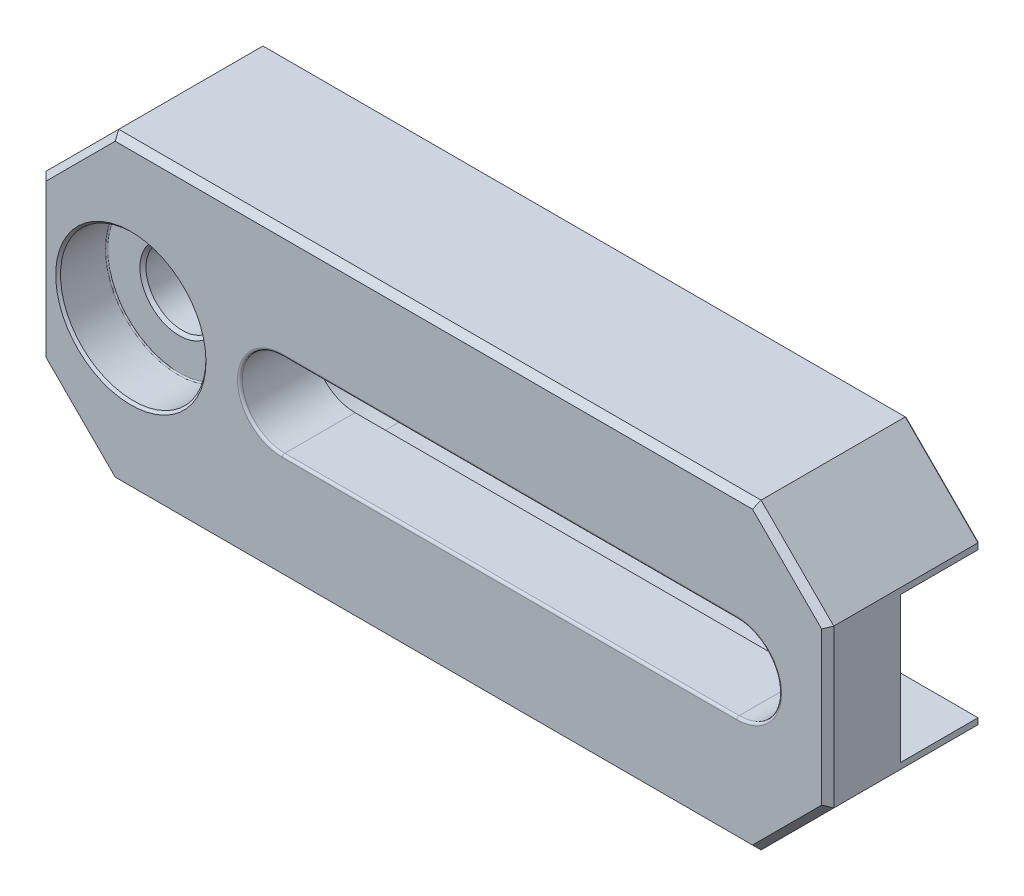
ISO-10303-21;
HEADER;
FILE_DESCRIPTION(('STEP AP214'),'2;1');
FILE_NAME('part.step','',(''),(''),'','','');
FILE_SCHEMA(('AUTOMOTIVE_DESIGN { 1 0 10303 214 1 1 1 1 }'));
ENDSEC;
DATA;
#1=APPLICATION_CONTEXT('core data for automotive mechanical design processes');
#2=APPLICATION_PROTOCOL_DEFINITION('international standard','automotive_design',2000,#1);
#3=PRODUCT_CONTEXT('',#1,'mechanical');
#4=PRODUCT('Part','Part','',(#3));
#5=PRODUCT_RELATED_PRODUCT_CATEGORY('part','',(#4));
#6=PRODUCT_DEFINITION_FORMATION('','',#4);
#7=PRODUCT_DEFINITION_CONTEXT('part definition',#1,'design');
#8=PRODUCT_DEFINITION('design','',#6,#7);
#9=PRODUCT_DEFINITION_SHAPE('','',#8);
#10=(LENGTH_UNIT() NAMED_UNIT(*) SI_UNIT(.MILLI.,.METRE.));
#11=(NAMED_UNIT(*) PLANE_ANGLE_UNIT() SI_UNIT($,.RADIAN.));
#12=(NAMED_UNIT(*) SI_UNIT($,.STERADIAN.) SOLID_ANGLE_UNIT());
#13=UNCERTAINTY_MEASURE_WITH_UNIT(LENGTH_MEASURE(1.E-05),#10,'distance_accuracy_value','');
#14=(GEOMETRIC_REPRESENTATION_CONTEXT(3) GLOBAL_UNCERTAINTY_ASSIGNED_CONTEXT((#13)) GLOBAL_UNIT_ASSIGNED_CONTEXT((#10,
#11,#12)) REPRESENTATION_CONTEXT('',''));
#15=CARTESIAN_POINT('',(0.,0.,0.));
#16=DIRECTION('',(0.,0.,1.));
#17=DIRECTION('',(1.,0.,0.));
#18=AXIS2_PLACEMENT_3D('',#15,#16,#17);
#19=CARTESIAN_POINT('',(0.,-12.5,12.5));
#20=DIRECTION('',(-1.,0.,0.));
#21=DIRECTION('',(0.,-1.,0.));
#22=AXIS2_PLACEMENT_3D('',#19,#20,#21);
#23=PLANE('',#22);
#24=DIRECTION('',(0.,0.,-1.));
#25=VECTOR('',#24,1.);
#26=CARTESIAN_POINT('',(0.,6.49999999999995,12.5));
#27=LINE('',#26,#25);
#28=CARTESIAN_POINT('',(0.,6.49999999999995,12.));
#29=VERTEX_POINT('',#28);
#30=CARTESIAN_POINT('',(0.,6.49999999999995,0.100000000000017));
#31=VERTEX_POINT('',#30);
#32=EDGE_CURVE('E283',#29,#31,#27,.T.);
#33=ORIENTED_EDGE('',*,*,#32,.T.);
#34=DIRECTION('',(0.,-1.,0.));
#35=VECTOR('',#34,1.);
#36=CARTESIAN_POINT('',(0.,-6.49999999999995,0.100000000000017));
#37=LINE('',#36,#35);
#38=CARTESIAN_POINT('',(0.,-6.49999999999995,0.100000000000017));
#39=VERTEX_POINT('',#38);
#40=EDGE_CURVE('E11',#31,#39,#37,.T.);
#41=ORIENTED_EDGE('',*,*,#40,.T.);
#42=DIRECTION('',(0.,0.,1.));
#43=VECTOR('',#42,1.);
#44=CARTESIAN_POINT('',(0.,-6.49999999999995,12.5));
#45=LINE('',#44,#43);
#46=CARTESIAN_POINT('',(0.,-6.49999999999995,12.));
#47=VERTEX_POINT('',#46);
#48=EDGE_CURVE('E281',#39,#47,#45,.T.);
#49=ORIENTED_EDGE('',*,*,#48,.T.);
#50=DIRECTION('',(0.,1.,0.));
#51=VECTOR('',#50,1.);
#52=CARTESIAN_POINT('',(0.,-12.5,12.));
#53=LINE('',#52,#51);
#54=EDGE_CURVE('E329',#47,#29,#53,.T.);
#55=ORIENTED_EDGE('',*,*,#54,.T.);
#56=EDGE_LOOP('',(#33,#41,#49,#55));
#57=FACE_BOUND('',#56,.T.);
#58=ADVANCED_FACE('F34',(#57),#23,.T.);
#59=CARTESIAN_POINT('',(65.,-12.5,12.5));
#60=DIRECTION('',(0.,-1.,0.));
#61=DIRECTION('',(1.,0.,0.));
#62=AXIS2_PLACEMENT_3D('',#59,#60,#61);
#63=PLANE('',#62);
#64=DIRECTION('',(0.,0.,-1.));
#65=VECTOR('',#64,1.);
#66=CARTESIAN_POINT('',(6.0000000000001,-12.5,12.5));
#67=LINE('',#66,#65);
#68=CARTESIAN_POINT('',(6.0000000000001,-12.5,12.));
#69=VERTEX_POINT('',#68);
#70=CARTESIAN_POINT('',(6.0000000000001,-12.5,0.100000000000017));
#71=VERTEX_POINT('',#70);
#72=EDGE_CURVE('E291',#69,#71,#67,.T.);
#73=ORIENTED_EDGE('',*,*,#72,.T.);
#74=DIRECTION('',(1.,0.,0.));
#75=VECTOR('',#74,1.);
#76=CARTESIAN_POINT('',(58.9999999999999,-12.5,0.100000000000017));
#77=LINE('',#76,#75);
#78=CARTESIAN_POINT('',(58.9999999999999,-12.5,0.100000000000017));
#79=VERTEX_POINT('',#78);
#80=EDGE_CURVE('E431',#71,#79,#77,.T.);
#81=ORIENTED_EDGE('',*,*,#80,.T.);
#82=DIRECTION('',(0.,0.,1.));
#83=VECTOR('',#82,1.);
#84=CARTESIAN_POINT('',(58.9999999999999,-12.5,12.5));
#85=LINE('',#84,#83);
#86=CARTESIAN_POINT('',(58.9999999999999,-12.5,12.));
#87=VERTEX_POINT('',#86);
#88=EDGE_CURVE('E289',#79,#87,#85,.T.);
#89=ORIENTED_EDGE('',*,*,#88,.T.);
#90=DIRECTION('',(-1.,0.,0.));
#91=VECTOR('',#90,1.);
#92=CARTESIAN_POINT('',(65.,-12.5,12.));
#93=LINE('',#92,#91);
#94=EDGE_CURVE('E324',#87,#69,#93,.T.);
#95=ORIENTED_EDGE('',*,*,#94,.T.);
#96=EDGE_LOOP('',(#73,#81,#89,#95));
#97=FACE_BOUND('',#96,.T.);
#98=ADVANCED_FACE('F518',(#97),#63,.T.);
#99=CARTESIAN_POINT('',(65.,12.5,12.5));
#100=DIRECTION('',(1.,0.,0.));
#101=DIRECTION('',(0.,0.,-1.));
#102=AXIS2_PLACEMENT_3D('',#99,#100,#101);
#103=PLANE('',#102);
#104=DIRECTION('',(0.,0.,-1.));
#105=VECTOR('',#104,1.);
#106=CARTESIAN_POINT('',(65.,-6.49999999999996,12.5));
#107=LINE('',#106,#105);
#108=CARTESIAN_POINT('',(65.,-6.49999999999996,12.));
#109=VERTEX_POINT('',#108);
#110=CARTESIAN_POINT('',(65.,-6.49999999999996,0.100000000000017));
#111=VERTEX_POINT('',#110);
#112=EDGE_CURVE('E296',#109,#111,#107,.T.);
#113=ORIENTED_EDGE('',*,*,#112,.T.);
#114=DIRECTION('',(0.,1.,0.));
#115=VECTOR('',#114,1.);
#116=CARTESIAN_POINT('',(65.,-6.,0.100000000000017));
#117=LINE('',#116,#115);
#118=CARTESIAN_POINT('',(65.,-6.,0.100000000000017));
#119=VERTEX_POINT('',#118);
#120=EDGE_CURVE('E437',#111,#119,#117,.T.);
#121=ORIENTED_EDGE('',*,*,#120,.T.);
#122=DIRECTION('',(0.,0.,-1.));
#123=VECTOR('',#122,1.);
#124=CARTESIAN_POINT('',(65.,-6.,12.5));
#125=LINE('',#124,#123);
#126=CARTESIAN_POINT('',(65.,-6.,6.5));
#127=VERTEX_POINT('',#126);
#128=EDGE_CURVE('E268',#127,#119,#125,.T.);
#129=ORIENTED_EDGE('',*,*,#128,.F.);
#130=DIRECTION('',(0.,1.,0.));
#131=VECTOR('',#130,1.);
#132=CARTESIAN_POINT('',(65.,12.5,6.5));
#133=LINE('',#132,#131);
#134=CARTESIAN_POINT('',(65.,5.99999999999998,6.5));
#135=VERTEX_POINT('',#134);
#136=EDGE_CURVE('E278',#127,#135,#133,.T.);
#137=ORIENTED_EDGE('',*,*,#136,.T.);
#138=DIRECTION('',(0.,0.,1.));
#139=VECTOR('',#138,1.);
#140=CARTESIAN_POINT('',(65.,5.99999999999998,12.5));
#141=LINE('',#140,#139);
#142=CARTESIAN_POINT('',(65.,5.99999999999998,0.100000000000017));
#143=VERTEX_POINT('',#142);
#144=EDGE_CURVE('E273',#143,#135,#141,.T.);
#145=ORIENTED_EDGE('',*,*,#144,.F.);
#146=DIRECTION('',(0.,1.,0.));
#147=VECTOR('',#146,1.);
#148=CARTESIAN_POINT('',(65.,6.49999999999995,0.100000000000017));
#149=LINE('',#148,#147);
#150=CARTESIAN_POINT('',(65.,6.49999999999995,0.100000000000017));
#151=VERTEX_POINT('',#150);
#152=EDGE_CURVE('E435',#143,#151,#149,.T.);
#153=ORIENTED_EDGE('',*,*,#152,.T.);
#154=DIRECTION('',(0.,0.,1.));
#155=VECTOR('',#154,1.);
#156=CARTESIAN_POINT('',(65.,6.49999999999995,12.5));
#157=LINE('',#156,#155);
#158=CARTESIAN_POINT('',(65.,6.49999999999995,12.));
#159=VERTEX_POINT('',#158);
#160=EDGE_CURVE('E294',#151,#159,#157,.T.);
#161=ORIENTED_EDGE('',*,*,#160,.T.);
#162=DIRECTION('',(0.,-1.,0.));
#163=VECTOR('',#162,1.);
#164=CARTESIAN_POINT('',(65.,12.5,12.));
#165=LINE('',#164,#163);
#166=EDGE_CURVE('E319',#159,#109,#165,.T.);
#167=ORIENTED_EDGE('',*,*,#166,.T.);
#168=EDGE_LOOP('',(#113,#121,#129,#137,#145,#153,#161,#167));
#169=FACE_BOUND('',#168,.T.);
#170=ADVANCED_FACE('F497',(#169),#103,.T.);
#171=CARTESIAN_POINT('',(0.,12.5,12.5));
#172=DIRECTION('',(0.,1.,0.));
#173=DIRECTION('',(-1.,0.,0.));
#174=AXIS2_PLACEMENT_3D('',#171,#172,#173);
#175=PLANE('',#174);
#176=DIRECTION('',(0.,0.,-1.));
#177=VECTOR('',#176,1.);
#178=CARTESIAN_POINT('',(58.9999999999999,12.5,12.5));
#179=LINE('',#178,#177);
#180=CARTESIAN_POINT('',(58.9999999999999,12.5,12.));
#181=VERTEX_POINT('',#180);
#182=CARTESIAN_POINT('',(58.9999999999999,12.5,0.100000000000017));
#183=VERTEX_POINT('',#182);
#184=EDGE_CURVE('E285',#181,#183,#179,.T.);
#185=ORIENTED_EDGE('',*,*,#184,.T.);
#186=DIRECTION('',(-1.,0.,0.));
#187=VECTOR('',#186,1.);
#188=CARTESIAN_POINT('',(6.0000000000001,12.5,0.100000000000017));
#189=LINE('',#188,#187);
#190=CARTESIAN_POINT('',(6.0000000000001,12.5,0.100000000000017));
#191=VERTEX_POINT('',#190);
#192=EDGE_CURVE('E58',#183,#191,#189,.T.);
#193=ORIENTED_EDGE('',*,*,#192,.T.);
#194=DIRECTION('',(0.,0.,1.));
#195=VECTOR('',#194,1.);
#196=CARTESIAN_POINT('',(6.0000000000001,12.5,12.5));
#197=LINE('',#196,#195);
#198=CARTESIAN_POINT('',(6.0000000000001,12.5,12.));
#199=VERTEX_POINT('',#198);
#200=EDGE_CURVE('E287',#191,#199,#197,.T.);
#201=ORIENTED_EDGE('',*,*,#200,.T.);
#202=DIRECTION('',(1.,0.,0.));
#203=VECTOR('',#202,1.);
#204=CARTESIAN_POINT('',(0.,12.5,12.));
#205=LINE('',#204,#203);
#206=EDGE_CURVE('E334',#199,#181,#205,.T.);
#207=ORIENTED_EDGE('',*,*,#206,.T.);
#208=EDGE_LOOP('',(#185,#193,#201,#207));
#209=FACE_BOUND('',#208,.T.);
#210=ADVANCED_FACE('F528',(#209),#175,.T.);
#211=CARTESIAN_POINT('',(0.,-12.5,12.5));
#212=DIRECTION('',(0.,0.,1.));
#213=DIRECTION('',(1.,0.,0.));
#214=AXIS2_PLACEMENT_3D('',#211,#212,#213);
#215=PLANE('',#214);
#216=CARTESIAN_POINT('',(7.5,0.,12.5));
#217=DIRECTION('',(0.,0.,1.));
#218=DIRECTION('',(1.,0.,0.));
#219=AXIS2_PLACEMENT_3D('',#216,#217,#218);
#220=CIRCLE('',#219,6.20000000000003);
#221=CARTESIAN_POINT('',(13.7,0.,12.5));
#222=VERTEX_POINT('',#221);
#223=EDGE_CURVE('E388',#222,#222,#220,.F.);
#224=ORIENTED_EDGE('',*,*,#223,.T.);
#225=EDGE_LOOP('',(#224));
#226=FACE_BOUND('',#225,.T.);
#227=DIRECTION('',(-1.,0.,0.));
#228=VECTOR('',#227,1.);
#229=CARTESIAN_POINT('',(57.5,3.7,12.5));
#230=LINE('',#229,#228);
#231=CARTESIAN_POINT('',(20.,3.7,12.5));
#232=VERTEX_POINT('',#231);
#233=CARTESIAN_POINT('',(57.5,3.7,12.5));
#234=VERTEX_POINT('',#233);
#235=EDGE_CURVE('E361',#232,#234,#230,.F.);
#236=ORIENTED_EDGE('',*,*,#235,.T.);
#237=CARTESIAN_POINT('',(57.5,0.,12.5));
#238=DIRECTION('',(0.,0.,1.));
#239=DIRECTION('',(1.,0.,0.));
#240=AXIS2_PLACEMENT_3D('',#237,#238,#239);
#241=CIRCLE('',#240,3.7);
#242=CARTESIAN_POINT('',(57.5,-3.7,12.5));
#243=VERTEX_POINT('',#242);
#244=EDGE_CURVE('E367',#234,#243,#241,.F.);
#245=ORIENTED_EDGE('',*,*,#244,.T.);
#246=DIRECTION('',(1.,0.,0.));
#247=VECTOR('',#246,1.);
#248=CARTESIAN_POINT('',(20.,-3.7,12.5));
#249=LINE('',#248,#247);
#250=CARTESIAN_POINT('',(20.,-3.7,12.5));
#251=VERTEX_POINT('',#250);
#252=EDGE_CURVE('E365',#243,#251,#249,.F.);
#253=ORIENTED_EDGE('',*,*,#252,.T.);
#254=CARTESIAN_POINT('',(20.,0.,12.5));
#255=DIRECTION('',(0.,0.,1.));
#256=DIRECTION('',(1.,0.,0.));
#257=AXIS2_PLACEMENT_3D('',#254,#255,#256);
#258=CIRCLE('',#257,3.7);
#259=EDGE_CURVE('E363',#251,#232,#258,.F.);
#260=ORIENTED_EDGE('',*,*,#259,.T.);
#261=EDGE_LOOP('',(#236,#245,#253,#260));
#262=FACE_BOUND('',#261,.T.);
#263=DIRECTION('',(0.,1.,0.));
#264=VECTOR('',#263,1.);
#265=CARTESIAN_POINT('',(64.5,-12.5,12.5));
#266=LINE('',#265,#264);
#267=CARTESIAN_POINT('',(64.5,-6.29289321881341,12.5));
#268=VERTEX_POINT('',#267);
#269=CARTESIAN_POINT('',(64.5,6.29289321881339,12.5));
#270=VERTEX_POINT('',#269);
#271=EDGE_CURVE('E311',#268,#270,#266,.T.);
#272=ORIENTED_EDGE('',*,*,#271,.T.);
#273=DIRECTION('',(-0.707106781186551,0.707106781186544,0.));
#274=VECTOR('',#273,1.);
#275=CARTESIAN_POINT('',(41.6464466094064,29.1464466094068,12.5));
#276=LINE('',#275,#274);
#277=CARTESIAN_POINT('',(58.7928932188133,12.,12.5));
#278=VERTEX_POINT('',#277);
#279=EDGE_CURVE('E313',#270,#278,#276,.T.);
#280=ORIENTED_EDGE('',*,*,#279,.T.);
#281=DIRECTION('',(-1.,0.,0.));
#282=VECTOR('',#281,1.);
#283=CARTESIAN_POINT('',(0.,12.,12.5));
#284=LINE('',#283,#282);
#285=CARTESIAN_POINT('',(6.20710678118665,12.,12.5));
#286=VERTEX_POINT('',#285);
#287=EDGE_CURVE('E299',#278,#286,#284,.T.);
#288=ORIENTED_EDGE('',*,*,#287,.T.);
#289=DIRECTION('',(-0.707106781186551,-0.707106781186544,0.));
#290=VECTOR('',#289,1.);
#291=CARTESIAN_POINT('',(-9.1464466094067,-3.3535533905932,12.5));
#292=LINE('',#291,#290);
#293=CARTESIAN_POINT('',(0.500000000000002,6.2928932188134,12.5));
#294=VERTEX_POINT('',#293);
#295=EDGE_CURVE('E301',#286,#294,#292,.T.);
#296=ORIENTED_EDGE('',*,*,#295,.T.);
#297=DIRECTION('',(0.,-1.,0.));
#298=VECTOR('',#297,1.);
#299=CARTESIAN_POINT('',(0.5,-12.5,12.5));
#300=LINE('',#299,#298);
#301=CARTESIAN_POINT('',(0.500000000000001,-6.29289321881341,12.5));
#302=VERTEX_POINT('',#301);
#303=EDGE_CURVE('E303',#294,#302,#300,.T.);
#304=ORIENTED_EDGE('',*,*,#303,.T.);
#305=DIRECTION('',(0.707106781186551,-0.707106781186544,0.));
#306=VECTOR('',#305,1.);
#307=CARTESIAN_POINT('',(3.35355339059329,-9.14644660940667,12.5));
#308=LINE('',#307,#306);
#309=CARTESIAN_POINT('',(6.20710678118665,-12.,12.5));
#310=VERTEX_POINT('',#309);
#311=EDGE_CURVE('E305',#302,#310,#308,.T.);
#312=ORIENTED_EDGE('',*,*,#311,.T.);
#313=DIRECTION('',(1.,0.,0.));
#314=VECTOR('',#313,1.);
#315=CARTESIAN_POINT('',(0.,-12.,12.5));
#316=LINE('',#315,#314);
#317=CARTESIAN_POINT('',(58.7928932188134,-12.,12.5));
#318=VERTEX_POINT('',#317);
#319=EDGE_CURVE('E307',#310,#318,#316,.T.);
#320=ORIENTED_EDGE('',*,*,#319,.T.);
#321=DIRECTION('',(0.707106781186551,0.707106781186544,0.));
#322=VECTOR('',#321,1.);
#323=CARTESIAN_POINT('',(29.1464466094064,-41.6464466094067,12.5));
#324=LINE('',#323,#322);
#325=EDGE_CURVE('E309',#318,#268,#324,.T.);
#326=ORIENTED_EDGE('',*,*,#325,.T.);
#327=EDGE_LOOP('',(#272,#280,#288,#296,#304,#312,#320,#326));
#328=FACE_BOUND('',#327,.T.);
#329=ADVANCED_FACE('F790',(#226,#262,#328),#215,.T.);
#330=CARTESIAN_POINT('',(0.,-12.5,0.));
#331=DIRECTION('',(0.,0.,1.));
#332=DIRECTION('',(1.,0.,0.));
#333=AXIS2_PLACEMENT_3D('',#330,#331,#332);
#334=PLANE('',#333);
#335=DIRECTION('',(-1.,0.,0.));
#336=VECTOR('',#335,1.);
#337=CARTESIAN_POINT('',(6.00000000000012,-12.4,0.));
#338=LINE('',#337,#336);
#339=CARTESIAN_POINT('',(58.9585786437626,-12.4,0.));
#340=VERTEX_POINT('',#339);
#341=CARTESIAN_POINT('',(6.04142135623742,-12.4,0.));
#342=VERTEX_POINT('',#341);
#343=EDGE_CURVE('E423',#340,#342,#338,.T.);
#344=ORIENTED_EDGE('',*,*,#343,.T.);
#345=DIRECTION('',(-0.707106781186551,0.707106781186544,0.));
#346=VECTOR('',#345,1.);
#347=CARTESIAN_POINT('',(0.0707106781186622,-6.42928932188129,0.));
#348=LINE('',#347,#346);
#349=CARTESIAN_POINT('',(0.100000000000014,-6.45857864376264,0.));
#350=VERTEX_POINT('',#349);
#351=EDGE_CURVE('E425',#342,#350,#348,.T.);
#352=ORIENTED_EDGE('',*,*,#351,.T.);
#353=DIRECTION('',(0.,1.,0.));
#354=VECTOR('',#353,1.);
#355=CARTESIAN_POINT('',(0.100000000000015,6.49999999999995,0.));
#356=LINE('',#355,#354);
#357=CARTESIAN_POINT('',(0.100000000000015,6.45857864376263,0.));
#358=VERTEX_POINT('',#357);
#359=EDGE_CURVE('E403',#350,#358,#356,.T.);
#360=ORIENTED_EDGE('',*,*,#359,.T.);
#361=DIRECTION('',(0.707106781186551,0.707106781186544,0.));
#362=VECTOR('',#361,1.);
#363=CARTESIAN_POINT('',(6.07071067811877,12.4292893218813,0.));
#364=LINE('',#363,#362);
#365=CARTESIAN_POINT('',(6.04142135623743,12.4,0.));
#366=VERTEX_POINT('',#365);
#367=EDGE_CURVE('E405',#358,#366,#364,.T.);
#368=ORIENTED_EDGE('',*,*,#367,.T.);
#369=DIRECTION('',(1.,0.,0.));
#370=VECTOR('',#369,1.);
#371=CARTESIAN_POINT('',(58.9999999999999,12.4,0.));
#372=LINE('',#371,#370);
#373=CARTESIAN_POINT('',(58.9585786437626,12.4,0.));
#374=VERTEX_POINT('',#373);
#375=EDGE_CURVE('E407',#366,#374,#372,.T.);
#376=ORIENTED_EDGE('',*,*,#375,.T.);
#377=DIRECTION('',(0.707106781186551,-0.707106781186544,0.));
#378=VECTOR('',#377,1.);
#379=CARTESIAN_POINT('',(64.9292893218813,6.42928932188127,0.));
#380=LINE('',#379,#378);
#381=CARTESIAN_POINT('',(64.9,6.45857864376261,0.));
#382=VERTEX_POINT('',#381);
#383=EDGE_CURVE('E409',#374,#382,#380,.T.);
#384=ORIENTED_EDGE('',*,*,#383,.T.);
#385=DIRECTION('',(0.,-1.,0.));
#386=VECTOR('',#385,1.);
#387=CARTESIAN_POINT('',(64.9,5.99999999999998,0.));
#388=LINE('',#387,#386);
#389=CARTESIAN_POINT('',(64.9,6.1,0.));
#390=VERTEX_POINT('',#389);
#391=EDGE_CURVE('E411',#382,#390,#388,.T.);
#392=ORIENTED_EDGE('',*,*,#391,.T.);
#393=DIRECTION('',(-1.,0.,0.));
#394=VECTOR('',#393,1.);
#395=CARTESIAN_POINT('',(0.,6.10000000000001,0.));
#396=LINE('',#395,#394);
#397=CARTESIAN_POINT('',(20.,6.10000000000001,0.));
#398=VERTEX_POINT('',#397);
#399=EDGE_CURVE('E413',#390,#398,#396,.T.);
#400=ORIENTED_EDGE('',*,*,#399,.T.);
#401=CARTESIAN_POINT('',(20.,0.,0.));
#402=DIRECTION('',(0.,0.,1.));
#403=DIRECTION('',(1.,0.,0.));
#404=AXIS2_PLACEMENT_3D('',#401,#402,#403);
#405=CIRCLE('',#404,6.10000000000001);
#406=CARTESIAN_POINT('',(20.,-6.10000000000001,0.));
#407=VERTEX_POINT('',#406);
#408=EDGE_CURVE('E415',#398,#407,#405,.T.);
#409=ORIENTED_EDGE('',*,*,#408,.T.);
#410=DIRECTION('',(1.,0.,0.));
#411=VECTOR('',#410,1.);
#412=CARTESIAN_POINT('',(0.,-6.10000000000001,0.));
#413=LINE('',#412,#411);
#414=CARTESIAN_POINT('',(64.9,-6.10000000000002,0.));
#415=VERTEX_POINT('',#414);
#416=EDGE_CURVE('E417',#407,#415,#413,.T.);
#417=ORIENTED_EDGE('',*,*,#416,.T.);
#418=DIRECTION('',(0.,-1.,0.));
#419=VECTOR('',#418,1.);
#420=CARTESIAN_POINT('',(64.9,-6.49999999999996,0.));
#421=LINE('',#420,#419);
#422=CARTESIAN_POINT('',(64.9,-6.45857864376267,0.));
#423=VERTEX_POINT('',#422);
#424=EDGE_CURVE('E419',#415,#423,#421,.T.);
#425=ORIENTED_EDGE('',*,*,#424,.T.);
#426=DIRECTION('',(-0.707106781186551,-0.707106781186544,0.));
#427=VECTOR('',#426,1.);
#428=CARTESIAN_POINT('',(58.9292893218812,-12.4292893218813,0.));
#429=LINE('',#428,#427);
#430=EDGE_CURVE('E421',#423,#340,#429,.T.);
#431=ORIENTED_EDGE('',*,*,#430,.T.);
#432=EDGE_LOOP('',(#344,#352,#360,#368,#376,#384,#392,#400,#409,#417,#425,#431));
#433=FACE_BOUND('',#432,.T.);
#434=CARTESIAN_POINT('',(7.5,0.,0.));
#435=DIRECTION('',(0.,0.,1.));
#436=DIRECTION('',(1.,0.,0.));
#437=AXIS2_PLACEMENT_3D('',#434,#435,#436);
#438=CIRCLE('',#437,3.00000000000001);
#439=CARTESIAN_POINT('',(10.5,0.,0.));
#440=VERTEX_POINT('',#439);
#441=EDGE_CURVE('E275',#440,#440,#438,.T.);
#442=ORIENTED_EDGE('',*,*,#441,.T.);
#443=EDGE_LOOP('',(#442));
#444=FACE_BOUND('',#443,.T.);
#445=ADVANCED_FACE('F784',(#433,#444),#334,.F.);
#446=CARTESIAN_POINT('',(7.5,0.,12.5));
#447=DIRECTION('',(0.,0.,1.));
#448=DIRECTION('',(1.,0.,0.));
#449=AXIS2_PLACEMENT_3D('',#446,#447,#448);
#450=CYLINDRICAL_SURFACE('',#449,6.00000000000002);
#451=CARTESIAN_POINT('',(7.5,0.,8.6));
#452=DIRECTION('',(0.,0.,-1.));
#453=DIRECTION('',(-1.,0.,0.));
#454=AXIS2_PLACEMENT_3D('',#451,#452,#453);
#455=CIRCLE('',#454,6.00000000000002);
#456=CARTESIAN_POINT('',(1.49999999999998,0.,8.6));
#457=VERTEX_POINT('',#456);
#458=EDGE_CURVE('E394',#457,#457,#455,.T.);
#459=ORIENTED_EDGE('',*,*,#458,.T.);
#460=EDGE_LOOP('',(#459));
#461=FACE_BOUND('',#460,.T.);
#462=CARTESIAN_POINT('',(7.5,0.,12.3));
#463=DIRECTION('',(0.,0.,1.));
#464=DIRECTION('',(1.,0.,0.));
#465=AXIS2_PLACEMENT_3D('',#462,#463,#464);
#466=CIRCLE('',#465,6.00000000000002);
#467=CARTESIAN_POINT('',(13.5,0.,12.3));
#468=VERTEX_POINT('',#467);
#469=EDGE_CURVE('E376',#468,#468,#466,.T.);
#470=ORIENTED_EDGE('',*,*,#469,.T.);
#471=EDGE_LOOP('',(#470));
#472=FACE_BOUND('',#471,.T.);
#473=ADVANCED_FACE('F789',(#461,#472),#450,.F.);
#474=CARTESIAN_POINT('',(10.5,0.,8.5));
#475=DIRECTION('',(0.,0.,-1.));
#476=DIRECTION('',(-1.,0.,0.));
#477=AXIS2_PLACEMENT_3D('',#474,#475,#476);
#478=PLANE('',#477);
#479=CARTESIAN_POINT('',(7.5,0.,8.5));
#480=DIRECTION('',(0.,0.,-1.));
#481=DIRECTION('',(-1.,0.,0.));
#482=AXIS2_PLACEMENT_3D('',#479,#480,#481);
#483=CIRCLE('',#482,3.25000000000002);
#484=CARTESIAN_POINT('',(4.24999999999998,0.,8.5));
#485=VERTEX_POINT('',#484);
#486=EDGE_CURVE('E400',#485,#485,#483,.T.);
#487=ORIENTED_EDGE('',*,*,#486,.T.);
#488=EDGE_LOOP('',(#487));
#489=FACE_BOUND('',#488,.T.);
#490=CARTESIAN_POINT('',(7.5,0.,8.5));
#491=DIRECTION('',(0.,0.,-1.));
#492=DIRECTION('',(-1.,0.,0.));
#493=AXIS2_PLACEMENT_3D('',#490,#491,#492);
#494=CIRCLE('',#493,5.90000000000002);
#495=CARTESIAN_POINT('',(1.59999999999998,0.,8.5));
#496=VERTEX_POINT('',#495);
#497=EDGE_CURVE('E391',#496,#496,#494,.F.);
#498=ORIENTED_EDGE('',*,*,#497,.T.);
#499=EDGE_LOOP('',(#498));
#500=FACE_BOUND('',#499,.T.);
#501=ADVANCED_FACE('F827',(#489,#500),#478,.F.);
#502=CARTESIAN_POINT('',(7.5,0.,12.5));
#503=DIRECTION('',(0.,0.,1.));
#504=DIRECTION('',(1.,0.,0.));
#505=AXIS2_PLACEMENT_3D('',#502,#503,#504);
#506=CYLINDRICAL_SURFACE('',#505,3.00000000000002);
#507=CARTESIAN_POINT('',(7.5,0.,8.25));
#508=DIRECTION('',(0.,0.,-1.));
#509=DIRECTION('',(-1.,0.,0.));
#510=AXIS2_PLACEMENT_3D('',#507,#508,#509);
#511=CIRCLE('',#510,3.00000000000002);
#512=CARTESIAN_POINT('',(4.49999999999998,0.,8.25));
#513=VERTEX_POINT('',#512);
#514=EDGE_CURVE('E397',#513,#513,#511,.F.);
#515=ORIENTED_EDGE('',*,*,#514,.T.);
#516=EDGE_LOOP('',(#515));
#517=FACE_BOUND('',#516,.T.);
#518=ORIENTED_EDGE('',*,*,#441,.F.);
#519=EDGE_LOOP('',(#518));
#520=FACE_BOUND('',#519,.T.);
#521=ADVANCED_FACE('F515',(#517,#520),#506,.F.);
#522=CARTESIAN_POINT('',(20.,5.99999999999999,6.5));
#523=DIRECTION('',(0.,1.,0.));
#524=DIRECTION('',(-1.,0.,0.));
#525=AXIS2_PLACEMENT_3D('',#522,#523,#524);
#526=PLANE('',#525);
#527=DIRECTION('',(0.,0.,-1.));
#528=VECTOR('',#527,1.);
#529=CARTESIAN_POINT('',(20.,5.99999999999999,6.5));
#530=LINE('',#529,#528);
#531=CARTESIAN_POINT('',(20.,5.99999999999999,6.5));
#532=VERTEX_POINT('',#531);
#533=CARTESIAN_POINT('',(20.,5.99999999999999,0.100000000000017));
#534=VERTEX_POINT('',#533);
#535=EDGE_CURVE('E265',#532,#534,#530,.T.);
#536=ORIENTED_EDGE('',*,*,#535,.T.);
#537=DIRECTION('',(1.,0.,0.));
#538=VECTOR('',#537,1.);
#539=CARTESIAN_POINT('',(20.,5.99999999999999,0.100000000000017));
#540=LINE('',#539,#538);
#541=EDGE_CURVE('E443',#534,#143,#540,.T.);
#542=ORIENTED_EDGE('',*,*,#541,.T.);
#543=ORIENTED_EDGE('',*,*,#144,.T.);
#544=DIRECTION('',(1.,0.,0.));
#545=VECTOR('',#544,1.);
#546=CARTESIAN_POINT('',(20.,5.99999999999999,6.5));
#547=LINE('',#546,#545);
#548=EDGE_CURVE('E261',#532,#135,#547,.T.);
#549=ORIENTED_EDGE('',*,*,#548,.F.);
#550=EDGE_LOOP('',(#536,#542,#543,#549));
#551=FACE_BOUND('',#550,.T.);
#552=ADVANCED_FACE('F494',(#551),#526,.F.);
#553=CARTESIAN_POINT('',(20.,0.,6.5));
#554=DIRECTION('',(0.,0.,-1.));
#555=DIRECTION('',(-1.,0.,0.));
#556=AXIS2_PLACEMENT_3D('',#553,#554,#555);
#557=CYLINDRICAL_SURFACE('',#556,5.99999999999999);
#558=DIRECTION('',(0.,0.,-1.));
#559=VECTOR('',#558,1.);
#560=CARTESIAN_POINT('',(20.,-6.,6.5));
#561=LINE('',#560,#559);
#562=CARTESIAN_POINT('',(20.,-6.,6.5));
#563=VERTEX_POINT('',#562);
#564=CARTESIAN_POINT('',(20.,-6.,0.100000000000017));
#565=VERTEX_POINT('',#564);
#566=EDGE_CURVE('E264',#563,#565,#561,.T.);
#567=ORIENTED_EDGE('',*,*,#566,.T.);
#568=CARTESIAN_POINT('',(20.,0.,0.100000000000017));
#569=DIRECTION('',(0.,0.,1.));
#570=DIRECTION('',(1.,0.,0.));
#571=AXIS2_PLACEMENT_3D('',#568,#569,#570);
#572=CIRCLE('',#571,5.99999999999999);
#573=EDGE_CURVE('E441',#565,#534,#572,.F.);
#574=ORIENTED_EDGE('',*,*,#573,.T.);
#575=ORIENTED_EDGE('',*,*,#535,.F.);
#576=CARTESIAN_POINT('',(20.,0.,6.5));
#577=DIRECTION('',(0.,0.,-1.));
#578=DIRECTION('',(-1.,0.,0.));
#579=AXIS2_PLACEMENT_3D('',#576,#577,#578);
#580=CIRCLE('',#579,5.99999999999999);
#581=EDGE_CURVE('E258',#563,#532,#580,.T.);
#582=ORIENTED_EDGE('',*,*,#581,.F.);
#583=EDGE_LOOP('',(#567,#574,#575,#582));
#584=FACE_BOUND('',#583,.T.);
#585=ADVANCED_FACE('F507',(#584),#557,.F.);
#586=CARTESIAN_POINT('',(70.,-6.,6.5));
#587=DIRECTION('',(0.,-1.,0.));
#588=DIRECTION('',(1.,0.,0.));
#589=AXIS2_PLACEMENT_3D('',#586,#587,#588);
#590=PLANE('',#589);
#591=ORIENTED_EDGE('',*,*,#128,.T.);
#592=DIRECTION('',(-1.,0.,0.));
#593=VECTOR('',#592,1.);
#594=CARTESIAN_POINT('',(70.,-6.,0.100000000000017));
#595=LINE('',#594,#593);
#596=EDGE_CURVE('E439',#119,#565,#595,.T.);
#597=ORIENTED_EDGE('',*,*,#596,.T.);
#598=ORIENTED_EDGE('',*,*,#566,.F.);
#599=DIRECTION('',(-1.,0.,0.));
#600=VECTOR('',#599,1.);
#601=CARTESIAN_POINT('',(70.,-6.,6.5));
#602=LINE('',#601,#600);
#603=EDGE_CURVE('E231',#127,#563,#602,.T.);
#604=ORIENTED_EDGE('',*,*,#603,.F.);
#605=EDGE_LOOP('',(#591,#597,#598,#604));
#606=FACE_BOUND('',#605,.T.);
#607=ADVANCED_FACE('F503',(#606),#590,.F.);
#608=CARTESIAN_POINT('',(20.,0.,6.5));
#609=DIRECTION('',(0.,0.,-1.));
#610=DIRECTION('',(-1.,0.,0.));
#611=AXIS2_PLACEMENT_3D('',#608,#609,#610);
#612=PLANE('',#611);
#613=CARTESIAN_POINT('',(57.5,0.,6.5));
#614=DIRECTION('',(0.,0.,-1.));
#615=DIRECTION('',(-1.,0.,0.));
#616=AXIS2_PLACEMENT_3D('',#613,#614,#615);
#617=CIRCLE('',#616,3.5);
#618=CARTESIAN_POINT('',(57.5,-3.5,6.5));
#619=VERTEX_POINT('',#618);
#620=CARTESIAN_POINT('',(57.5,3.5,6.5));
#621=VERTEX_POINT('',#620);
#622=EDGE_CURVE('E238',#619,#621,#617,.F.);
#623=ORIENTED_EDGE('',*,*,#622,.T.);
#624=DIRECTION('',(-1.,0.,0.));
#625=VECTOR('',#624,1.);
#626=CARTESIAN_POINT('',(57.5,3.5,6.5));
#627=LINE('',#626,#625);
#628=CARTESIAN_POINT('',(20.,3.5,6.5));
#629=VERTEX_POINT('',#628);
#630=EDGE_CURVE('E221',#621,#629,#627,.T.);
#631=ORIENTED_EDGE('',*,*,#630,.T.);
#632=CARTESIAN_POINT('',(20.,0.,6.5));
#633=DIRECTION('',(0.,0.,-1.));
#634=DIRECTION('',(-1.,0.,0.));
#635=AXIS2_PLACEMENT_3D('',#632,#633,#634);
#636=CIRCLE('',#635,3.5);
#637=CARTESIAN_POINT('',(20.,-3.5,6.5));
#638=VERTEX_POINT('',#637);
#639=EDGE_CURVE('E248',#629,#638,#636,.F.);
#640=ORIENTED_EDGE('',*,*,#639,.T.);
#641=DIRECTION('',(1.,0.,0.));
#642=VECTOR('',#641,1.);
#643=CARTESIAN_POINT('',(20.,-3.5,6.5));
#644=LINE('',#643,#642);
#645=EDGE_CURVE('E246',#638,#619,#644,.T.);
#646=ORIENTED_EDGE('',*,*,#645,.T.);
#647=EDGE_LOOP('',(#623,#631,#640,#646));
#648=FACE_BOUND('',#647,.T.);
#649=ORIENTED_EDGE('',*,*,#603,.T.);
#650=ORIENTED_EDGE('',*,*,#581,.T.);
#651=ORIENTED_EDGE('',*,*,#548,.T.);
#652=ORIENTED_EDGE('',*,*,#136,.F.);
#653=EDGE_LOOP('',(#649,#650,#651,#652));
#654=FACE_BOUND('',#653,.T.);
#655=ADVANCED_FACE('F244',(#648,#654),#612,.T.);
#656=CARTESIAN_POINT('',(57.5,0.,-0.000999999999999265));
#657=DIRECTION('',(0.,0.,1.));
#658=DIRECTION('',(1.,0.,0.));
#659=AXIS2_PLACEMENT_3D('',#656,#657,#658);
#660=CYLINDRICAL_SURFACE('',#659,3.5);
#661=DIRECTION('',(0.,0.,1.));
#662=VECTOR('',#661,1.);
#663=CARTESIAN_POINT('',(57.5,-3.5,-0.000999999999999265));
#664=LINE('',#663,#662);
#665=CARTESIAN_POINT('',(57.5,-3.5,12.3));
#666=VERTEX_POINT('',#665);
#667=EDGE_CURVE('E232',#619,#666,#664,.T.);
#668=ORIENTED_EDGE('',*,*,#667,.T.);
#669=CARTESIAN_POINT('',(57.5,0.,12.3));
#670=DIRECTION('',(0.,0.,1.));
#671=DIRECTION('',(1.,0.,0.));
#672=AXIS2_PLACEMENT_3D('',#669,#670,#671);
#673=CIRCLE('',#672,3.5);
#674=CARTESIAN_POINT('',(57.5,3.5,12.3));
#675=VERTEX_POINT('',#674);
#676=EDGE_CURVE('E241',#666,#675,#673,.T.);
#677=ORIENTED_EDGE('',*,*,#676,.T.);
#678=DIRECTION('',(0.,0.,1.));
#679=VECTOR('',#678,1.);
#680=CARTESIAN_POINT('',(57.5,3.5,-0.000999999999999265));
#681=LINE('',#680,#679);
#682=EDGE_CURVE('E224',#621,#675,#681,.T.);
#683=ORIENTED_EDGE('',*,*,#682,.F.);
#684=ORIENTED_EDGE('',*,*,#622,.F.);
#685=EDGE_LOOP('',(#668,#677,#683,#684));
#686=FACE_BOUND('',#685,.T.);
#687=ADVANCED_FACE('F237',(#686),#660,.F.);
#688=CARTESIAN_POINT('',(20.,-3.5,-0.000999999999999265));
#689=DIRECTION('',(0.,-1.,0.));
#690=DIRECTION('',(1.,0.,0.));
#691=AXIS2_PLACEMENT_3D('',#688,#689,#690);
#692=PLANE('',#691);
#693=DIRECTION('',(0.,0.,1.));
#694=VECTOR('',#693,1.);
#695=CARTESIAN_POINT('',(20.,-3.5,-0.000999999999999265));
#696=LINE('',#695,#694);
#697=CARTESIAN_POINT('',(20.,-3.5,12.3));
#698=VERTEX_POINT('',#697);
#699=EDGE_CURVE('E253',#638,#698,#696,.T.);
#700=ORIENTED_EDGE('',*,*,#699,.T.);
#701=DIRECTION('',(1.,0.,0.));
#702=VECTOR('',#701,1.);
#703=CARTESIAN_POINT('',(57.5,-3.5,12.3));
#704=LINE('',#703,#702);
#705=EDGE_CURVE('E370',#698,#666,#704,.T.);
#706=ORIENTED_EDGE('',*,*,#705,.T.);
#707=ORIENTED_EDGE('',*,*,#667,.F.);
#708=ORIENTED_EDGE('',*,*,#645,.F.);
#709=EDGE_LOOP('',(#700,#706,#707,#708));
#710=FACE_BOUND('',#709,.T.);
#711=ADVANCED_FACE('F745',(#710),#692,.F.);
#712=CARTESIAN_POINT('',(20.,0.,-0.000999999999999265));
#713=DIRECTION('',(0.,0.,1.));
#714=DIRECTION('',(1.,0.,0.));
#715=AXIS2_PLACEMENT_3D('',#712,#713,#714);
#716=CYLINDRICAL_SURFACE('',#715,3.5);
#717=DIRECTION('',(0.,0.,1.));
#718=VECTOR('',#717,1.);
#719=CARTESIAN_POINT('',(20.,3.5,-0.000999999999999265));
#720=LINE('',#719,#718);
#721=CARTESIAN_POINT('',(20.,3.5,12.3));
#722=VERTEX_POINT('',#721);
#723=EDGE_CURVE('E226',#629,#722,#720,.T.);
#724=ORIENTED_EDGE('',*,*,#723,.T.);
#725=CARTESIAN_POINT('',(20.,0.,12.3));
#726=DIRECTION('',(0.,0.,1.));
#727=DIRECTION('',(1.,0.,0.));
#728=AXIS2_PLACEMENT_3D('',#725,#726,#727);
#729=CIRCLE('',#728,3.5);
#730=EDGE_CURVE('E372',#722,#698,#729,.T.);
#731=ORIENTED_EDGE('',*,*,#730,.T.);
#732=ORIENTED_EDGE('',*,*,#699,.F.);
#733=ORIENTED_EDGE('',*,*,#639,.F.);
#734=EDGE_LOOP('',(#724,#731,#732,#733));
#735=FACE_BOUND('',#734,.T.);
#736=ADVANCED_FACE('F738',(#735),#716,.F.);
#737=CARTESIAN_POINT('',(57.5,3.5,-0.000999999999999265));
#738=DIRECTION('',(0.,1.,0.));
#739=DIRECTION('',(-1.,0.,0.));
#740=AXIS2_PLACEMENT_3D('',#737,#738,#739);
#741=PLANE('',#740);
#742=ORIENTED_EDGE('',*,*,#682,.T.);
#743=DIRECTION('',(-1.,0.,0.));
#744=VECTOR('',#743,1.);
#745=CARTESIAN_POINT('',(20.,3.5,12.3));
#746=LINE('',#745,#744);
#747=EDGE_CURVE('E374',#675,#722,#746,.T.);
#748=ORIENTED_EDGE('',*,*,#747,.T.);
#749=ORIENTED_EDGE('',*,*,#723,.F.);
#750=ORIENTED_EDGE('',*,*,#630,.F.);
#751=EDGE_LOOP('',(#742,#748,#749,#750));
#752=FACE_BOUND('',#751,.T.);
#753=ADVANCED_FACE('F223',(#752),#741,.F.);
#754=CARTESIAN_POINT('',(0.,6.49999999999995,12.5));
#755=DIRECTION('',(0.707106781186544,-0.707106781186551,0.));
#756=DIRECTION('',(0.707106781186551,0.707106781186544,0.));
#757=AXIS2_PLACEMENT_3D('',#754,#755,#756);
#758=PLANE('',#757);
#759=ORIENTED_EDGE('',*,*,#200,.F.);
#760=DIRECTION('',(0.707106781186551,0.707106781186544,0.));
#761=VECTOR('',#760,1.);
#762=CARTESIAN_POINT('',(0.,6.49999999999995,0.100000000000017));
#763=LINE('',#762,#761);
#764=EDGE_CURVE('E43',#191,#31,#763,.F.);
#765=ORIENTED_EDGE('',*,*,#764,.T.);
#766=ORIENTED_EDGE('',*,*,#32,.F.);
#767=DIRECTION('',(-0.707106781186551,-0.707106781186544,0.));
#768=VECTOR('',#767,1.);
#769=CARTESIAN_POINT('',(0.,6.49999999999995,12.));
#770=LINE('',#769,#768);
#771=EDGE_CURVE('E331',#29,#199,#770,.F.);
#772=ORIENTED_EDGE('',*,*,#771,.T.);
#773=EDGE_LOOP('',(#759,#765,#766,#772));
#774=FACE_BOUND('',#773,.T.);
#775=ADVANCED_FACE('F530',(#774),#758,.F.);
#776=CARTESIAN_POINT('',(6.0000000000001,-12.5,12.5));
#777=DIRECTION('',(0.707106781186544,0.707106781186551,0.));
#778=DIRECTION('',(-0.707106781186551,0.707106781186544,0.));
#779=AXIS2_PLACEMENT_3D('',#776,#777,#778);
#780=PLANE('',#779);
#781=ORIENTED_EDGE('',*,*,#48,.F.);
#782=DIRECTION('',(-0.707106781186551,0.707106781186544,0.));
#783=VECTOR('',#782,1.);
#784=CARTESIAN_POINT('',(6.00000000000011,-12.5,0.100000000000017));
#785=LINE('',#784,#783);
#786=EDGE_CURVE('E428',#39,#71,#785,.F.);
#787=ORIENTED_EDGE('',*,*,#786,.T.);
#788=ORIENTED_EDGE('',*,*,#72,.F.);
#789=DIRECTION('',(0.707106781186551,-0.707106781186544,0.));
#790=VECTOR('',#789,1.);
#791=CARTESIAN_POINT('',(6.0000000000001,-12.5,12.));
#792=LINE('',#791,#790);
#793=EDGE_CURVE('E326',#69,#47,#792,.F.);
#794=ORIENTED_EDGE('',*,*,#793,.T.);
#795=EDGE_LOOP('',(#781,#787,#788,#794));
#796=FACE_BOUND('',#795,.T.);
#797=ADVANCED_FACE('F533',(#796),#780,.F.);
#798=CARTESIAN_POINT('',(65.,-6.49999999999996,12.5));
#799=DIRECTION('',(-0.707106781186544,0.707106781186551,0.));
#800=DIRECTION('',(-0.707106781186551,-0.707106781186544,0.));
#801=AXIS2_PLACEMENT_3D('',#798,#799,#800);
#802=PLANE('',#801);
#803=ORIENTED_EDGE('',*,*,#88,.F.);
#804=DIRECTION('',(-0.707106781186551,-0.707106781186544,0.));
#805=VECTOR('',#804,1.);
#806=CARTESIAN_POINT('',(65.,-6.49999999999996,0.100000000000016));
#807=LINE('',#806,#805);
#808=EDGE_CURVE('E433',#79,#111,#807,.F.);
#809=ORIENTED_EDGE('',*,*,#808,.T.);
#810=ORIENTED_EDGE('',*,*,#112,.F.);
#811=DIRECTION('',(0.707106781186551,0.707106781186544,0.));
#812=VECTOR('',#811,1.);
#813=CARTESIAN_POINT('',(65.,-6.49999999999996,12.));
#814=LINE('',#813,#812);
#815=EDGE_CURVE('E321',#109,#87,#814,.F.);
#816=ORIENTED_EDGE('',*,*,#815,.T.);
#817=EDGE_LOOP('',(#803,#809,#810,#816));
#818=FACE_BOUND('',#817,.T.);
#819=ADVANCED_FACE('F536',(#818),#802,.F.);
#820=CARTESIAN_POINT('',(58.9999999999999,12.5,12.5));
#821=DIRECTION('',(-0.707106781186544,-0.707106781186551,0.));
#822=DIRECTION('',(0.707106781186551,-0.707106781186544,0.));
#823=AXIS2_PLACEMENT_3D('',#820,#821,#822);
#824=PLANE('',#823);
#825=ORIENTED_EDGE('',*,*,#160,.F.);
#826=DIRECTION('',(0.707106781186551,-0.707106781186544,0.));
#827=VECTOR('',#826,1.);
#828=CARTESIAN_POINT('',(58.9999999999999,12.5,0.100000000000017));
#829=LINE('',#828,#827);
#830=EDGE_CURVE('E445',#151,#183,#829,.F.);
#831=ORIENTED_EDGE('',*,*,#830,.T.);
#832=ORIENTED_EDGE('',*,*,#184,.F.);
#833=DIRECTION('',(-0.707106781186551,0.707106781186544,0.));
#834=VECTOR('',#833,1.);
#835=CARTESIAN_POINT('',(58.9999999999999,12.5,12.));
#836=LINE('',#835,#834);
#837=EDGE_CURVE('E316',#181,#159,#836,.F.);
#838=ORIENTED_EDGE('',*,*,#837,.T.);
#839=EDGE_LOOP('',(#825,#831,#832,#838));
#840=FACE_BOUND('',#839,.T.);
#841=ADVANCED_FACE('F540',(#840),#824,.F.);
#842=CARTESIAN_POINT('',(3.35355339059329,-9.14644660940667,12.5));
#843=DIRECTION('',(-0.5,-0.500000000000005,0.707106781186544));
#844=DIRECTION('',(0.,-0.816496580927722,-0.577350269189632));
#845=AXIS2_PLACEMENT_3D('',#842,#843,#844);
#846=PLANE('',#845);
#847=DIRECTION('',(-0.678598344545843,-0.28108463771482,-0.678598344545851));
#848=VECTOR('',#847,1.);
#849=CARTESIAN_POINT('',(-1.14446141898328,-6.97405144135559,10.8555385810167));
#850=LINE('',#849,#848);
#851=EDGE_CURVE('E354',#47,#302,#850,.F.);
#852=ORIENTED_EDGE('',*,*,#851,.F.);
#853=ORIENTED_EDGE('',*,*,#793,.F.);
#854=DIRECTION('',(-0.281084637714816,-0.678598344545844,-0.678598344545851));
#855=VECTOR('',#854,1.);
#856=CARTESIAN_POINT('',(6.52594855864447,-11.2302478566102,13.2697521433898));
#857=LINE('',#856,#855);
#858=EDGE_CURVE('E357',#310,#69,#857,.T.);
#859=ORIENTED_EDGE('',*,*,#858,.F.);
#860=ORIENTED_EDGE('',*,*,#311,.F.);
#861=EDGE_LOOP('',(#852,#853,#859,#860));
#862=FACE_BOUND('',#861,.T.);
#863=ADVANCED_FACE('F544',(#862),#846,.T.);
#864=CARTESIAN_POINT('',(65.,-12.5,12.));
#865=DIRECTION('',(0.,0.707106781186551,-0.707106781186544));
#866=DIRECTION('',(0.,0.707106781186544,0.707106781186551));
#867=AXIS2_PLACEMENT_3D('',#864,#865,#866);
#868=PLANE('',#867);
#869=ORIENTED_EDGE('',*,*,#858,.T.);
#870=ORIENTED_EDGE('',*,*,#94,.F.);
#871=DIRECTION('',(0.281084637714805,-0.678598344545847,-0.678598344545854));
#872=VECTOR('',#871,1.);
#873=CARTESIAN_POINT('',(59.4740514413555,-13.6444614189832,10.8555385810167));
#874=LINE('',#873,#872);
#875=EDGE_CURVE('E351',#318,#87,#874,.T.);
#876=ORIENTED_EDGE('',*,*,#875,.F.);
#877=ORIENTED_EDGE('',*,*,#319,.F.);
#878=EDGE_LOOP('',(#869,#870,#876,#877));
#879=FACE_BOUND('',#878,.T.);
#880=ADVANCED_FACE('F570',(#879),#868,.F.);
#881=CARTESIAN_POINT('',(0.,-12.5,12.));
#882=DIRECTION('',(0.707106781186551,0.,-0.707106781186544));
#883=DIRECTION('',(-0.707106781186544,0.,-0.707106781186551));
#884=AXIS2_PLACEMENT_3D('',#881,#882,#883);
#885=PLANE('',#884);
#886=ORIENTED_EDGE('',*,*,#851,.T.);
#887=ORIENTED_EDGE('',*,*,#303,.F.);
#888=DIRECTION('',(-0.678598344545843,0.281084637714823,-0.67859834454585));
#889=VECTOR('',#888,1.);
#890=CARTESIAN_POINT('',(-2.10214964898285,7.37073889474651,9.89785035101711));
#891=LINE('',#890,#889);
#892=EDGE_CURVE('E348',#29,#294,#891,.F.);
#893=ORIENTED_EDGE('',*,*,#892,.F.);
#894=ORIENTED_EDGE('',*,*,#54,.F.);
#895=EDGE_LOOP('',(#886,#887,#893,#894));
#896=FACE_BOUND('',#895,.T.);
#897=ADVANCED_FACE('F566',(#896),#885,.F.);
#898=CARTESIAN_POINT('',(29.1464466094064,-41.6464466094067,12.5));
#899=DIRECTION('',(0.500000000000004,-0.500000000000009,0.707106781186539));
#900=DIRECTION('',(0.,-0.816496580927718,-0.577350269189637));
#901=AXIS2_PLACEMENT_3D('',#898,#899,#900);
#902=PLANE('',#901);
#903=ORIENTED_EDGE('',*,*,#875,.T.);
#904=ORIENTED_EDGE('',*,*,#815,.F.);
#905=DIRECTION('',(0.678598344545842,-0.281084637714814,-0.678598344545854));
#906=VECTOR('',#905,1.);
#907=CARTESIAN_POINT('',(54.963303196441,-2.34266406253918,22.0366968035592));
#908=LINE('',#907,#906);
#909=EDGE_CURVE('E345',#268,#109,#908,.T.);
#910=ORIENTED_EDGE('',*,*,#909,.F.);
#911=ORIENTED_EDGE('',*,*,#325,.F.);
#912=EDGE_LOOP('',(#903,#904,#910,#911));
#913=FACE_BOUND('',#912,.T.);
#914=ADVANCED_FACE('F562',(#913),#902,.T.);
#915=CARTESIAN_POINT('',(-9.1464466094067,-3.3535533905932,12.5));
#916=DIRECTION('',(-0.5,0.500000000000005,0.707106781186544));
#917=DIRECTION('',(0.,-0.816496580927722,0.577350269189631));
#918=AXIS2_PLACEMENT_3D('',#915,#916,#917);
#919=PLANE('',#918);
#920=ORIENTED_EDGE('',*,*,#892,.T.);
#921=ORIENTED_EDGE('',*,*,#295,.F.);
#922=DIRECTION('',(-0.281084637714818,0.678598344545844,-0.678598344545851));
#923=VECTOR('',#922,1.);
#924=CARTESIAN_POINT('',(5.52594855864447,13.6444614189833,10.8555385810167));
#925=LINE('',#924,#923);
#926=EDGE_CURVE('E342',#199,#286,#925,.F.);
#927=ORIENTED_EDGE('',*,*,#926,.F.);
#928=ORIENTED_EDGE('',*,*,#771,.F.);
#929=EDGE_LOOP('',(#920,#921,#927,#928));
#930=FACE_BOUND('',#929,.T.);
#931=ADVANCED_FACE('F558',(#930),#919,.T.);
#932=CARTESIAN_POINT('',(65.,12.5,12.));
#933=DIRECTION('',(-0.707106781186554,0.,-0.707106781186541));
#934=DIRECTION('',(-0.707106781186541,0.,0.707106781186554));
#935=AXIS2_PLACEMENT_3D('',#932,#933,#934);
#936=PLANE('',#935);
#937=ORIENTED_EDGE('',*,*,#909,.T.);
#938=ORIENTED_EDGE('',*,*,#166,.F.);
#939=DIRECTION('',(0.67859834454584,0.281084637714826,-0.678598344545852));
#940=VECTOR('',#939,1.);
#941=CARTESIAN_POINT('',(66.1444614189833,6.9740514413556,10.8555385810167));
#942=LINE('',#941,#940);
#943=EDGE_CURVE('E338',#270,#159,#942,.T.);
#944=ORIENTED_EDGE('',*,*,#943,.F.);
#945=ORIENTED_EDGE('',*,*,#271,.F.);
#946=EDGE_LOOP('',(#937,#938,#944,#945));
#947=FACE_BOUND('',#946,.T.);
#948=ADVANCED_FACE('F554',(#947),#936,.F.);
#949=CARTESIAN_POINT('',(0.,12.5,12.));
#950=DIRECTION('',(0.,-0.707106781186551,-0.707106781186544));
#951=DIRECTION('',(0.,0.707106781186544,-0.707106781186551));
#952=AXIS2_PLACEMENT_3D('',#949,#950,#951);
#953=PLANE('',#952);
#954=ORIENTED_EDGE('',*,*,#926,.T.);
#955=ORIENTED_EDGE('',*,*,#287,.F.);
#956=DIRECTION('',(-0.281084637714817,-0.678598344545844,0.678598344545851));
#957=VECTOR('',#956,1.);
#958=CARTESIAN_POINT('',(54.338494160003,1.24612937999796,23.2538706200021));
#959=LINE('',#958,#957);
#960=EDGE_CURVE('E336',#181,#278,#959,.T.);
#961=ORIENTED_EDGE('',*,*,#960,.F.);
#962=ORIENTED_EDGE('',*,*,#206,.F.);
#963=EDGE_LOOP('',(#954,#955,#961,#962));
#964=FACE_BOUND('',#963,.T.);
#965=ADVANCED_FACE('F550',(#964),#953,.F.);
#966=CARTESIAN_POINT('',(41.6464466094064,29.1464466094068,12.5));
#967=DIRECTION('',(0.5,0.500000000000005,0.707106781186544));
#968=DIRECTION('',(0.,-0.816496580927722,0.577350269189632));
#969=AXIS2_PLACEMENT_3D('',#966,#967,#968);
#970=PLANE('',#969);
#971=ORIENTED_EDGE('',*,*,#943,.T.);
#972=ORIENTED_EDGE('',*,*,#837,.F.);
#973=ORIENTED_EDGE('',*,*,#960,.T.);
#974=ORIENTED_EDGE('',*,*,#279,.F.);
#975=EDGE_LOOP('',(#971,#972,#973,#974));
#976=FACE_BOUND('',#975,.T.);
#977=ADVANCED_FACE('F546',(#976),#970,.T.);
#978=CARTESIAN_POINT('',(20.,0.,12.3));
#979=DIRECTION('',(0.,0.,1.));
#980=DIRECTION('',(1.,0.,0.));
#981=AXIS2_PLACEMENT_3D('',#978,#979,#980);
#982=TOROIDAL_SURFACE('',#981,3.7,0.2);
#983=CARTESIAN_POINT('',(20.,3.70000000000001,12.3));
#984=DIRECTION('',(1.,0.,0.));
#985=DIRECTION('',(0.,0.,-1.));
#986=AXIS2_PLACEMENT_3D('',#983,#984,#985);
#987=CIRCLE('',#986,0.2);
#988=EDGE_CURVE('E381',#232,#722,#987,.T.);
#989=ORIENTED_EDGE('',*,*,#988,.F.);
#990=ORIENTED_EDGE('',*,*,#259,.F.);
#991=CARTESIAN_POINT('',(20.,-3.7,12.3));
#992=DIRECTION('',(1.,0.,0.));
#993=DIRECTION('',(0.,0.,-1.));
#994=AXIS2_PLACEMENT_3D('',#991,#992,#993);
#995=CIRCLE('',#994,0.2);
#996=EDGE_CURVE('E339',#698,#251,#995,.T.);
#997=ORIENTED_EDGE('',*,*,#996,.F.);
#998=ORIENTED_EDGE('',*,*,#730,.F.);
#999=EDGE_LOOP('',(#989,#990,#997,#998));
#1000=FACE_BOUND('',#999,.T.);
#1001=ADVANCED_FACE('F549',(#1000),#982,.T.);
#1002=CARTESIAN_POINT('',(20.,-3.7,12.3));
#1003=DIRECTION('',(-1.,0.,0.));
#1004=DIRECTION('',(0.,-1.,0.));
#1005=AXIS2_PLACEMENT_3D('',#1002,#1003,#1004);
#1006=CYLINDRICAL_SURFACE('',#1005,0.2);
#1007=ORIENTED_EDGE('',*,*,#996,.T.);
#1008=ORIENTED_EDGE('',*,*,#252,.F.);
#1009=CARTESIAN_POINT('',(57.5,-3.7,12.3));
#1010=DIRECTION('',(1.,0.,0.));
#1011=DIRECTION('',(0.,0.,-1.));
#1012=AXIS2_PLACEMENT_3D('',#1009,#1010,#1011);
#1013=CIRCLE('',#1012,0.2);
#1014=EDGE_CURVE('E379',#666,#243,#1013,.T.);
#1015=ORIENTED_EDGE('',*,*,#1014,.F.);
#1016=ORIENTED_EDGE('',*,*,#705,.F.);
#1017=EDGE_LOOP('',(#1007,#1008,#1015,#1016));
#1018=FACE_BOUND('',#1017,.T.);
#1019=ADVANCED_FACE('F586',(#1018),#1006,.T.);
#1020=CARTESIAN_POINT('',(57.5,3.7,12.3));
#1021=DIRECTION('',(1.,0.,0.));
#1022=DIRECTION('',(0.,1.,0.));
#1023=AXIS2_PLACEMENT_3D('',#1020,#1021,#1022);
#1024=CYLINDRICAL_SURFACE('',#1023,0.2);
#1025=ORIENTED_EDGE('',*,*,#988,.T.);
#1026=ORIENTED_EDGE('',*,*,#747,.F.);
#1027=CARTESIAN_POINT('',(57.5,3.7,12.3));
#1028=DIRECTION('',(1.,0.,0.));
#1029=DIRECTION('',(0.,0.,-1.));
#1030=AXIS2_PLACEMENT_3D('',#1027,#1028,#1029);
#1031=CIRCLE('',#1030,0.2);
#1032=EDGE_CURVE('E377',#234,#675,#1031,.T.);
#1033=ORIENTED_EDGE('',*,*,#1032,.F.);
#1034=ORIENTED_EDGE('',*,*,#235,.F.);
#1035=EDGE_LOOP('',(#1025,#1026,#1033,#1034));
#1036=FACE_BOUND('',#1035,.T.);
#1037=ADVANCED_FACE('F582',(#1036),#1024,.T.);
#1038=CARTESIAN_POINT('',(57.5,0.,12.3));
#1039=DIRECTION('',(0.,0.,1.));
#1040=DIRECTION('',(1.,0.,0.));
#1041=AXIS2_PLACEMENT_3D('',#1038,#1039,#1040);
#1042=TOROIDAL_SURFACE('',#1041,3.7,0.2);
#1043=ORIENTED_EDGE('',*,*,#1014,.T.);
#1044=ORIENTED_EDGE('',*,*,#244,.F.);
#1045=ORIENTED_EDGE('',*,*,#1032,.T.);
#1046=ORIENTED_EDGE('',*,*,#676,.F.);
#1047=EDGE_LOOP('',(#1043,#1044,#1045,#1046));
#1048=FACE_BOUND('',#1047,.T.);
#1049=ADVANCED_FACE('F578',(#1048),#1042,.T.);
#1050=CARTESIAN_POINT('',(7.5,0.,12.3));
#1051=DIRECTION('',(0.,0.,1.));
#1052=DIRECTION('',(1.,0.,0.));
#1053=AXIS2_PLACEMENT_3D('',#1050,#1051,#1052);
#1054=CONICAL_SURFACE('',#1053,6.00000000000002,0.785398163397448);
#1055=CARTESIAN_POINT('',(13.7,0.,12.5));
#1056=CARTESIAN_POINT('',(13.6979166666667,0.,12.4979166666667));
#1057=CARTESIAN_POINT('',(13.6958333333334,0.,12.4958333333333));
#1058=CARTESIAN_POINT('',(13.6916666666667,0.,12.4916666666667));
#1059=CARTESIAN_POINT('',(13.6895833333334,0.,12.4895833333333));
#1060=CARTESIAN_POINT('',(13.6854166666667,0.,12.4854166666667));
#1061=CARTESIAN_POINT('',(13.6833333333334,0.,12.4833333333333));
#1062=CARTESIAN_POINT('',(13.6791666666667,0.,12.4791666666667));
#1063=CARTESIAN_POINT('',(13.6770833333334,0.,12.4770833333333));
#1064=CARTESIAN_POINT('',(13.6729166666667,0.,12.4729166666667));
#1065=CARTESIAN_POINT('',(13.6708333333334,0.,12.4708333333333));
#1066=CARTESIAN_POINT('',(13.6666666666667,0.,12.4666666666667));
#1067=CARTESIAN_POINT('',(13.6645833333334,0.,12.4645833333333));
#1068=CARTESIAN_POINT('',(13.6604166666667,0.,12.4604166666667));
#1069=CARTESIAN_POINT('',(13.6583333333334,0.,12.4583333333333));
#1070=CARTESIAN_POINT('',(13.6541666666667,0.,12.4541666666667));
#1071=CARTESIAN_POINT('',(13.6520833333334,0.,12.4520833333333));
#1072=CARTESIAN_POINT('',(13.6479166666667,0.,12.4479166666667));
#1073=CARTESIAN_POINT('',(13.6458333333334,0.,12.4458333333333));
#1074=CARTESIAN_POINT('',(13.6416666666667,0.,12.4416666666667));
#1075=CARTESIAN_POINT('',(13.6395833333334,0.,12.4395833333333));
#1076=CARTESIAN_POINT('',(13.6354166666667,0.,12.4354166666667));
#1077=CARTESIAN_POINT('',(13.6333333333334,0.,12.4333333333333));
#1078=CARTESIAN_POINT('',(13.6291666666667,0.,12.4291666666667));
#1079=CARTESIAN_POINT('',(13.6270833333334,0.,12.4270833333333));
#1080=CARTESIAN_POINT('',(13.6229166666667,0.,12.4229166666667));
#1081=CARTESIAN_POINT('',(13.6208333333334,0.,12.4208333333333));
#1082=CARTESIAN_POINT('',(13.6166666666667,0.,12.4166666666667));
#1083=CARTESIAN_POINT('',(13.6145833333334,0.,12.4145833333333));
#1084=CARTESIAN_POINT('',(13.6104166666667,0.,12.4104166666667));
#1085=CARTESIAN_POINT('',(13.6083333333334,0.,12.4083333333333));
#1086=CARTESIAN_POINT('',(13.6041666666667,0.,12.4041666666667));
#1087=CARTESIAN_POINT('',(13.6020833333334,0.,12.4020833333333));
#1088=CARTESIAN_POINT('',(13.5979166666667,0.,12.3979166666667));
#1089=CARTESIAN_POINT('',(13.5958333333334,0.,12.3958333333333));
#1090=CARTESIAN_POINT('',(13.5916666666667,0.,12.3916666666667));
#1091=CARTESIAN_POINT('',(13.5895833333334,0.,12.3895833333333));
#1092=CARTESIAN_POINT('',(13.5854166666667,0.,12.3854166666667));
#1093=CARTESIAN_POINT('',(13.5833333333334,0.,12.3833333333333));
#1094=CARTESIAN_POINT('',(13.5791666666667,0.,12.3791666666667));
#1095=CARTESIAN_POINT('',(13.5770833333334,0.,12.3770833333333));
#1096=CARTESIAN_POINT('',(13.5729166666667,0.,12.3729166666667));
#1097=CARTESIAN_POINT('',(13.5708333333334,0.,12.3708333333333));
#1098=CARTESIAN_POINT('',(13.5666666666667,0.,12.3666666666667));
#1099=CARTESIAN_POINT('',(13.5645833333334,0.,12.3645833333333));
#1100=CARTESIAN_POINT('',(13.5604166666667,0.,12.3604166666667));
#1101=CARTESIAN_POINT('',(13.5583333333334,0.,12.3583333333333));
#1102=CARTESIAN_POINT('',(13.5541666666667,0.,12.3541666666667));
#1103=CARTESIAN_POINT('',(13.5520833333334,0.,12.3520833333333));
#1104=CARTESIAN_POINT('',(13.5479166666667,0.,12.3479166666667));
#1105=CARTESIAN_POINT('',(13.5458333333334,0.,12.3458333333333));
#1106=CARTESIAN_POINT('',(13.5416666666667,0.,12.3416666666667));
#1107=CARTESIAN_POINT('',(13.5395833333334,0.,12.3395833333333));
#1108=CARTESIAN_POINT('',(13.5354166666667,0.,12.3354166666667));
#1109=CARTESIAN_POINT('',(13.5333333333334,0.,12.3333333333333));
#1110=CARTESIAN_POINT('',(13.5291666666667,0.,12.3291666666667));
#1111=CARTESIAN_POINT('',(13.5270833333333,0.,12.3270833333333));
#1112=CARTESIAN_POINT('',(13.5229166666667,0.,12.3229166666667));
#1113=CARTESIAN_POINT('',(13.5208333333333,0.,12.3208333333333));
#1114=CARTESIAN_POINT('',(13.5166666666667,0.,12.3166666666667));
#1115=CARTESIAN_POINT('',(13.5145833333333,0.,12.3145833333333));
#1116=CARTESIAN_POINT('',(13.5104166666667,0.,12.3104166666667));
#1117=CARTESIAN_POINT('',(13.5083333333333,0.,12.3083333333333));
#1118=CARTESIAN_POINT('',(13.5041666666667,0.,12.3041666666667));
#1119=CARTESIAN_POINT('',(13.5020833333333,0.,12.3020833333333));
#1120=CARTESIAN_POINT('',(13.5,0.,12.3));
#1121=B_SPLINE_CURVE_WITH_KNOTS('',3,(#1055,#1056,#1057,#1058,#1059,#1060,#1061,#1062,#1063,
#1064,#1065,#1066,#1067,#1068,#1069,#1070,#1071,#1072,#1073,#1074,#1075,#1076,#1077,#1078,#1079,
#1080,#1081,#1082,#1083,#1084,#1085,#1086,#1087,#1088,#1089,#1090,#1091,#1092,#1093,#1094,#1095,
#1096,#1097,#1098,#1099,#1100,#1101,#1102,#1103,#1104,#1105,#1106,#1107,#1108,#1109,#1110,#1111,
#1112,#1113,#1114,#1115,#1116,#1117,#1118,#1119,#1120),.UNSPECIFIED.,.F.,.F.,(4,2,2,2,2,2,2,2,2,
2,2,2,2,2,2,2,2,2,2,2,2,2,2,2,2,2,2,2,2,2,2,2,4),(0.,0.0088388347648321,0.0176776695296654,
0.0265165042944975,0.0353553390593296,0.0441941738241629,0.053033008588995,0.0618718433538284,
0.0707106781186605,0.0795495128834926,0.0883883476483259,0.097227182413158,0.106066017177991,
0.114904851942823,0.123743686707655,0.132582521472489,0.141421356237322,0.150260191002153,
0.159099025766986,0.16793786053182,0.176776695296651,0.185615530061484,0.194454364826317,
0.203293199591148,0.212132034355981,0.220970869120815,0.229809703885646,0.238648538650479,
0.247487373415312,0.256326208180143,0.265165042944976,0.27400387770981,0.282842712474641),.UNSPECIFIED.);
#1122=EDGE_CURVE('BSEAM581',#222,#468,#1121,.T.);
#1123=ORIENTED_EDGE('',*,*,#223,.F.);
#1124=ORIENTED_EDGE('',*,*,#469,.F.);
#1125=ORIENTED_EDGE('',*,*,#1122,.T.);
#1126=ORIENTED_EDGE('',*,*,#1122,.F.);
#1127=EDGE_LOOP('',(#1123,#1125,#1124,#1126));
#1128=FACE_BOUND('',#1127,.T.);
#1129=ADVANCED_FACE('F581',(#1128),#1054,.F.);
#1130=CARTESIAN_POINT('',(7.5,0.,8.6));
#1131=DIRECTION('',(0.,0.,-1.));
#1132=DIRECTION('',(-1.,0.,0.));
#1133=AXIS2_PLACEMENT_3D('',#1130,#1131,#1132);
#1134=TOROIDAL_SURFACE('',#1133,5.90000000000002,0.1);
#1135=ORIENTED_EDGE('',*,*,#458,.F.);
#1136=EDGE_LOOP('',(#1135));
#1137=FACE_BOUND('',#1136,.T.);
#1138=ORIENTED_EDGE('',*,*,#497,.F.);
#1139=EDGE_LOOP('',(#1138));
#1140=FACE_BOUND('',#1139,.T.);
#1141=ADVANCED_FACE('F596',(#1137,#1140),#1134,.F.);
#1142=CARTESIAN_POINT('',(7.5,0.,8.25));
#1143=DIRECTION('',(0.,0.,1.));
#1144=DIRECTION('',(1.,0.,0.));
#1145=AXIS2_PLACEMENT_3D('',#1142,#1143,#1144);
#1146=CONICAL_SURFACE('',#1145,3.00000000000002,0.785398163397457);
#1147=ORIENTED_EDGE('',*,*,#486,.F.);
#1148=EDGE_LOOP('',(#1147));
#1149=FACE_BOUND('',#1148,.T.);
#1150=ORIENTED_EDGE('',*,*,#514,.F.);
#1151=EDGE_LOOP('',(#1150));
#1152=FACE_BOUND('',#1151,.T.);
#1153=ADVANCED_FACE('F600',(#1149,#1152),#1146,.F.);
#1154=CARTESIAN_POINT('',(20.,5.99999999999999,0.100000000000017));
#1155=DIRECTION('',(0.,0.70710678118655,0.707106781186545));
#1156=DIRECTION('',(0.,-0.707106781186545,0.70710678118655));
#1157=AXIS2_PLACEMENT_3D('',#1154,#1155,#1156);
#1158=PLANE('',#1157);
#1159=DIRECTION('',(0.577350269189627,-0.577350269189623,0.577350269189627));
#1160=VECTOR('',#1159,1.);
#1161=CARTESIAN_POINT('',(71.1,-0.0999999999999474,6.19999999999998));
#1162=LINE('',#1161,#1160);
#1163=EDGE_CURVE('E476',#143,#390,#1162,.F.);
#1164=ORIENTED_EDGE('',*,*,#1163,.F.);
#1165=ORIENTED_EDGE('',*,*,#541,.F.);
#1166=DIRECTION('',(0.,-0.707106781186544,0.707106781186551));
#1167=VECTOR('',#1166,1.);
#1168=CARTESIAN_POINT('',(20.,6.10000000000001,0.));
#1169=LINE('',#1168,#1167);
#1170=EDGE_CURVE('E38',#398,#534,#1169,.T.);
#1171=ORIENTED_EDGE('',*,*,#1170,.F.);
#1172=ORIENTED_EDGE('',*,*,#399,.F.);
#1173=EDGE_LOOP('',(#1164,#1165,#1171,#1172));
#1174=FACE_BOUND('',#1173,.T.);
#1175=ADVANCED_FACE('F36',(#1174),#1158,.F.);
#1176=CARTESIAN_POINT('',(20.,0.,0.100000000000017));
#1177=DIRECTION('',(0.,0.,-1.));
#1178=DIRECTION('',(-1.,0.,0.));
#1179=AXIS2_PLACEMENT_3D('',#1176,#1177,#1178);
#1180=CONICAL_SURFACE('',#1179,5.99999999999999,0.785398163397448);
#1181=ORIENTED_EDGE('',*,*,#1170,.T.);
#1182=ORIENTED_EDGE('',*,*,#573,.F.);
#1183=DIRECTION('',(0.,0.707106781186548,0.707106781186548));
#1184=VECTOR('',#1183,1.);
#1185=CARTESIAN_POINT('',(20.,-6.10000000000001,0.));
#1186=LINE('',#1185,#1184);
#1187=EDGE_CURVE('E474',#407,#565,#1186,.T.);
#1188=ORIENTED_EDGE('',*,*,#1187,.F.);
#1189=ORIENTED_EDGE('',*,*,#408,.F.);
#1190=EDGE_LOOP('',(#1181,#1182,#1188,#1189));
#1191=FACE_BOUND('',#1190,.T.);
#1192=ADVANCED_FACE('F487',(#1191),#1180,.F.);
#1193=CARTESIAN_POINT('',(64.9,-12.5,0.));
#1194=DIRECTION('',(0.707106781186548,0.,-0.707106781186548));
#1195=DIRECTION('',(-0.707106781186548,0.,-0.707106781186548));
#1196=AXIS2_PLACEMENT_3D('',#1193,#1194,#1195);
#1197=PLANE('',#1196);
#1198=ORIENTED_EDGE('',*,*,#1163,.T.);
#1199=ORIENTED_EDGE('',*,*,#391,.F.);
#1200=DIRECTION('',(0.678598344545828,0.281084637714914,0.678598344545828));
#1201=VECTOR('',#1200,1.);
#1202=CARTESIAN_POINT('',(58.7036015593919,3.89194637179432,-6.19639844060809));
#1203=LINE('',#1202,#1201);
#1204=EDGE_CURVE('E471',#151,#382,#1203,.F.);
#1205=ORIENTED_EDGE('',*,*,#1204,.F.);
#1206=ORIENTED_EDGE('',*,*,#152,.F.);
#1207=EDGE_LOOP('',(#1198,#1199,#1205,#1206));
#1208=FACE_BOUND('',#1207,.T.);
#1209=ADVANCED_FACE('F640',(#1208),#1197,.T.);
#1210=CARTESIAN_POINT('',(0.,-6.10000000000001,0.));
#1211=DIRECTION('',(0.,-0.707106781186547,0.707106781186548));
#1212=DIRECTION('',(0.,-0.707106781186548,-0.707106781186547));
#1213=AXIS2_PLACEMENT_3D('',#1210,#1211,#1212);
#1214=PLANE('',#1213);
#1215=ORIENTED_EDGE('',*,*,#1187,.T.);
#1216=ORIENTED_EDGE('',*,*,#596,.F.);
#1217=DIRECTION('',(0.577350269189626,0.577350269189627,0.577350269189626));
#1218=VECTOR('',#1217,1.);
#1219=CARTESIAN_POINT('',(43.2666666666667,-27.7333333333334,-21.6333333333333));
#1220=LINE('',#1219,#1218);
#1221=EDGE_CURVE('E468',#415,#119,#1220,.T.);
#1222=ORIENTED_EDGE('',*,*,#1221,.F.);
#1223=ORIENTED_EDGE('',*,*,#416,.F.);
#1224=EDGE_LOOP('',(#1215,#1216,#1222,#1223));
#1225=FACE_BOUND('',#1224,.T.);
#1226=ADVANCED_FACE('F636',(#1225),#1214,.F.);
#1227=CARTESIAN_POINT('',(41.929289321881,29.4292893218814,0.));
#1228=DIRECTION('',(-0.499999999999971,-0.499999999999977,0.707106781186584));
#1229=DIRECTION('',(0.,-0.816496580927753,-0.577350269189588));
#1230=AXIS2_PLACEMENT_3D('',#1227,#1228,#1229);
#1231=PLANE('',#1230);
#1232=ORIENTED_EDGE('',*,*,#1204,.T.);
#1233=ORIENTED_EDGE('',*,*,#383,.F.);
#1234=DIRECTION('',(0.281084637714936,0.678598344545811,0.678598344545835));
#1235=VECTOR('',#1234,1.);
#1236=CARTESIAN_POINT('',(54.3003454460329,1.15403023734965,-11.2459697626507));
#1237=LINE('',#1236,#1235);
#1238=EDGE_CURVE('E465',#183,#374,#1237,.F.);
#1239=ORIENTED_EDGE('',*,*,#1238,.F.);
#1240=ORIENTED_EDGE('',*,*,#830,.F.);
#1241=EDGE_LOOP('',(#1232,#1233,#1239,#1240));
#1242=FACE_BOUND('',#1241,.T.);
#1243=ADVANCED_FACE('F632',(#1242),#1231,.F.);
#1244=CARTESIAN_POINT('',(64.9,-12.5,0.));
#1245=DIRECTION('',(0.707106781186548,0.,-0.707106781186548));
#1246=DIRECTION('',(-0.707106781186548,0.,-0.707106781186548));
#1247=AXIS2_PLACEMENT_3D('',#1244,#1245,#1246);
#1248=PLANE('',#1247);
#1249=ORIENTED_EDGE('',*,*,#1221,.T.);
#1250=ORIENTED_EDGE('',*,*,#120,.F.);
#1251=DIRECTION('',(0.678598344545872,-0.281084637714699,0.678598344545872));
#1252=VECTOR('',#1251,1.);
#1253=CARTESIAN_POINT('',(66.0523622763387,-6.93590272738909,1.15236227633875));
#1254=LINE('',#1253,#1252);
#1255=EDGE_CURVE('E462',#423,#111,#1254,.T.);
#1256=ORIENTED_EDGE('',*,*,#1255,.F.);
#1257=ORIENTED_EDGE('',*,*,#424,.F.);
#1258=EDGE_LOOP('',(#1249,#1250,#1256,#1257));
#1259=FACE_BOUND('',#1258,.T.);
#1260=ADVANCED_FACE('F628',(#1259),#1248,.T.);
#1261=CARTESIAN_POINT('',(0.,12.4,0.));
#1262=DIRECTION('',(0.,0.70710678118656,-0.707106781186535));
#1263=DIRECTION('',(0.,0.707106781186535,0.70710678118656));
#1264=AXIS2_PLACEMENT_3D('',#1261,#1262,#1263);
#1265=PLANE('',#1264);
#1266=ORIENTED_EDGE('',*,*,#1238,.T.);
#1267=ORIENTED_EDGE('',*,*,#375,.F.);
#1268=DIRECTION('',(-0.281084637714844,0.67859834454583,0.678598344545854));
#1269=VECTOR('',#1268,1.);
#1270=CARTESIAN_POINT('',(7.77004115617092,8.22674263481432,-4.17325736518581));
#1271=LINE('',#1270,#1269);
#1272=EDGE_CURVE('E459',#191,#366,#1271,.F.);
#1273=ORIENTED_EDGE('',*,*,#1272,.F.);
#1274=ORIENTED_EDGE('',*,*,#192,.F.);
#1275=EDGE_LOOP('',(#1266,#1267,#1273,#1274));
#1276=FACE_BOUND('',#1275,.T.);
#1277=ADVANCED_FACE('F624',(#1276),#1265,.T.);
#1278=CARTESIAN_POINT('',(29.429289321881,-41.9292893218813,0.));
#1279=DIRECTION('',(-0.500000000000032,0.500000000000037,0.707106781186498));
#1280=DIRECTION('',(0.,-0.816496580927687,0.577350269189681));
#1281=AXIS2_PLACEMENT_3D('',#1278,#1279,#1280);
#1282=PLANE('',#1281);
#1283=ORIENTED_EDGE('',*,*,#1255,.T.);
#1284=ORIENTED_EDGE('',*,*,#808,.F.);
#1285=DIRECTION('',(0.281084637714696,-0.678598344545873,0.678598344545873));
#1286=VECTOR('',#1285,1.);
#1287=CARTESIAN_POINT('',(62.2580336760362,-20.3655890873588,7.9655890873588));
#1288=LINE('',#1287,#1286);
#1289=EDGE_CURVE('E456',#340,#79,#1288,.T.);
#1290=ORIENTED_EDGE('',*,*,#1289,.F.);
#1291=ORIENTED_EDGE('',*,*,#430,.F.);
#1292=EDGE_LOOP('',(#1283,#1284,#1290,#1291));
#1293=FACE_BOUND('',#1292,.T.);
#1294=ADVANCED_FACE('F620',(#1293),#1282,.F.);
#1295=CARTESIAN_POINT('',(-9.42928932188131,-3.07071067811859,0.));
#1296=DIRECTION('',(0.499999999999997,-0.500000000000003,0.707106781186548));
#1297=DIRECTION('',(0.,-0.816496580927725,-0.577350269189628));
#1298=AXIS2_PLACEMENT_3D('',#1295,#1296,#1297);
#1299=PLANE('',#1298);
#1300=ORIENTED_EDGE('',*,*,#1272,.T.);
#1301=ORIENTED_EDGE('',*,*,#367,.F.);
#1302=DIRECTION('',(-0.678598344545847,0.281084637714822,0.678598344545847));
#1303=VECTOR('',#1302,1.);
#1304=CARTESIAN_POINT('',(3.71622696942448,4.96068838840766,-3.61622696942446));
#1305=LINE('',#1304,#1303);
#1306=EDGE_CURVE('E453',#31,#358,#1305,.F.);
#1307=ORIENTED_EDGE('',*,*,#1306,.F.);
#1308=ORIENTED_EDGE('',*,*,#764,.F.);
#1309=EDGE_LOOP('',(#1300,#1301,#1307,#1308));
#1310=FACE_BOUND('',#1309,.T.);
#1311=ADVANCED_FACE('F616',(#1310),#1299,.F.);
#1312=CARTESIAN_POINT('',(0.,-12.4,0.));
#1313=DIRECTION('',(0.,-0.707106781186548,-0.707106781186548));
#1314=DIRECTION('',(0.,0.707106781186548,-0.707106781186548));
#1315=AXIS2_PLACEMENT_3D('',#1312,#1313,#1314);
#1316=PLANE('',#1315);
#1317=ORIENTED_EDGE('',*,*,#1289,.T.);
#1318=ORIENTED_EDGE('',*,*,#80,.F.);
#1319=DIRECTION('',(-0.281084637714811,-0.678598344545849,0.678598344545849));
#1320=VECTOR('',#1319,1.);
#1321=CARTESIAN_POINT('',(5.56409727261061,-13.5523622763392,1.15236227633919));
#1322=LINE('',#1321,#1320);
#1323=EDGE_CURVE('E451',#342,#71,#1322,.T.);
#1324=ORIENTED_EDGE('',*,*,#1323,.F.);
#1325=ORIENTED_EDGE('',*,*,#343,.F.);
#1326=EDGE_LOOP('',(#1317,#1318,#1324,#1325));
#1327=FACE_BOUND('',#1326,.T.);
#1328=ADVANCED_FACE('F612',(#1327),#1316,.T.);
#1329=CARTESIAN_POINT('',(0.100000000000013,-12.5,0.));
#1330=DIRECTION('',(-0.707106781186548,0.,-0.707106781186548));
#1331=DIRECTION('',(-0.707106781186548,0.,0.707106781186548));
#1332=AXIS2_PLACEMENT_3D('',#1329,#1330,#1331);
#1333=PLANE('',#1332);
#1334=ORIENTED_EDGE('',*,*,#1306,.T.);
#1335=ORIENTED_EDGE('',*,*,#359,.F.);
#1336=DIRECTION('',(0.678598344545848,0.281084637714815,-0.678598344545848));
#1337=VECTOR('',#1336,1.);
#1338=CARTESIAN_POINT('',(-1.05236227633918,-6.93590272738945,1.15236227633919));
#1339=LINE('',#1338,#1337);
#1340=EDGE_CURVE('E449',#39,#350,#1339,.T.);
#1341=ORIENTED_EDGE('',*,*,#1340,.F.);
#1342=ORIENTED_EDGE('',*,*,#40,.F.);
#1343=EDGE_LOOP('',(#1334,#1335,#1341,#1342));
#1344=FACE_BOUND('',#1343,.T.);
#1345=ADVANCED_FACE('F608',(#1344),#1333,.T.);
#1346=CARTESIAN_POINT('',(3.07071067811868,-9.42928932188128,0.));
#1347=DIRECTION('',(0.5,0.500000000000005,0.707106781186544));
#1348=DIRECTION('',(0.,-0.816496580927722,0.577350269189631));
#1349=AXIS2_PLACEMENT_3D('',#1346,#1347,#1348);
#1350=PLANE('',#1349);
#1351=ORIENTED_EDGE('',*,*,#1323,.T.);
#1352=ORIENTED_EDGE('',*,*,#786,.F.);
#1353=ORIENTED_EDGE('',*,*,#1340,.T.);
#1354=ORIENTED_EDGE('',*,*,#351,.F.);
#1355=EDGE_LOOP('',(#1351,#1352,#1353,#1354));
#1356=FACE_BOUND('',#1355,.T.);
#1357=ADVANCED_FACE('F605',(#1356),#1350,.F.);
#1358=CLOSED_SHELL('',(#58,#98,#170,#210,#329,#445,#473,#501,#521,#552,#585,#607,#655,#687,#711,
#736,#753,#775,#797,#819,#841,#863,#880,#897,#914,#931,#948,#965,#977,#1001,#1019,#1037,#1049,
#1129,#1141,#1153,#1175,#1192,#1209,#1226,#1243,#1260,#1277,#1294,#1311,#1328,#1345,#1357));
#1359=MANIFOLD_SOLID_BREP('B2',#1358);
#1360=ADVANCED_BREP_SHAPE_REPRESENTATION('',(#18,#1359),#14);
#1361=SHAPE_DEFINITION_REPRESENTATION(#9,#1360);
ENDSEC;
END-ISO-10303-21;
